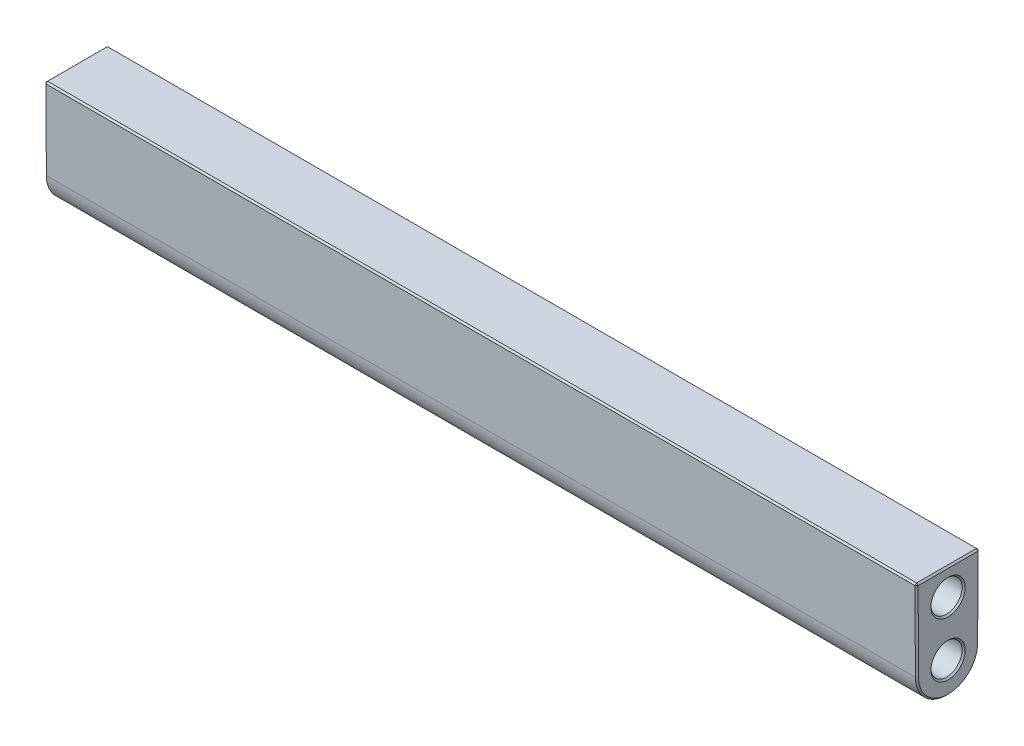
ISO-10303-21;
HEADER;
FILE_DESCRIPTION(('STEP AP214'),'2;1');
FILE_NAME('part.step','',(''),(''),'','','');
FILE_SCHEMA(('AUTOMOTIVE_DESIGN { 1 0 10303 214 1 1 1 1 }'));
ENDSEC;
DATA;
#1=APPLICATION_CONTEXT('core data for automotive mechanical design processes');
#2=APPLICATION_PROTOCOL_DEFINITION('international standard','automotive_design',2000,#1);
#3=PRODUCT_CONTEXT('',#1,'mechanical');
#4=PRODUCT('Part','Part','',(#3));
#5=PRODUCT_RELATED_PRODUCT_CATEGORY('part','',(#4));
#6=PRODUCT_DEFINITION_FORMATION('','',#4);
#7=PRODUCT_DEFINITION_CONTEXT('part definition',#1,'design');
#8=PRODUCT_DEFINITION('design','',#6,#7);
#9=PRODUCT_DEFINITION_SHAPE('','',#8);
#10=(LENGTH_UNIT() NAMED_UNIT(*) SI_UNIT(.MILLI.,.METRE.));
#11=(NAMED_UNIT(*) PLANE_ANGLE_UNIT() SI_UNIT($,.RADIAN.));
#12=(NAMED_UNIT(*) SI_UNIT($,.STERADIAN.) SOLID_ANGLE_UNIT());
#13=UNCERTAINTY_MEASURE_WITH_UNIT(LENGTH_MEASURE(1.E-05),#10,'distance_accuracy_value','');
#14=(GEOMETRIC_REPRESENTATION_CONTEXT(3) GLOBAL_UNCERTAINTY_ASSIGNED_CONTEXT((#13)) GLOBAL_UNIT_ASSIGNED_CONTEXT((#10,
#11,#12)) REPRESENTATION_CONTEXT('',''));
#15=CARTESIAN_POINT('',(0.,0.,0.));
#16=DIRECTION('',(0.,0.,1.));
#17=DIRECTION('',(1.,0.,0.));
#18=AXIS2_PLACEMENT_3D('',#15,#16,#17);
#19=CARTESIAN_POINT('',(-140.,0.,0.));
#20=DIRECTION('',(1.,0.,0.));
#21=DIRECTION('',(0.,0.,-1.));
#22=AXIS2_PLACEMENT_3D('',#19,#20,#21);
#23=PLANE('',#22);
#24=CARTESIAN_POINT('',(-140.,0.,0.));
#25=DIRECTION('',(1.,0.,0.));
#26=DIRECTION('',(0.,0.,-1.));
#27=AXIS2_PLACEMENT_3D('',#24,#25,#26);
#28=CIRCLE('',#27,5.50000000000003);
#29=CARTESIAN_POINT('',(-140.,0.,-5.50000000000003));
#30=VERTEX_POINT('',#29);
#31=EDGE_CURVE('E181',#30,#30,#28,.T.);
#32=ORIENTED_EDGE('',*,*,#31,.T.);
#33=EDGE_LOOP('',(#32));
#34=FACE_BOUND('',#33,.T.);
#35=CARTESIAN_POINT('',(-140.,17.5,0.));
#36=DIRECTION('',(1.,0.,0.));
#37=DIRECTION('',(0.,0.,-1.));
#38=AXIS2_PLACEMENT_3D('',#35,#36,#37);
#39=CIRCLE('',#38,5.50000000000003);
#40=CARTESIAN_POINT('',(-140.,17.5,-5.50000000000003));
#41=VERTEX_POINT('',#40);
#42=EDGE_CURVE('E178',#41,#41,#39,.T.);
#43=ORIENTED_EDGE('',*,*,#42,.T.);
#44=EDGE_LOOP('',(#43));
#45=FACE_BOUND('',#44,.T.);
#46=DIRECTION('',(0.,0.999991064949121,0.00422729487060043));
#47=VECTOR('',#46,1.);
#48=CARTESIAN_POINT('',(-140.,-0.0401593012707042,9.49991511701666));
#49=LINE('',#48,#47);
#50=CARTESIAN_POINT('',(-140.,-0.0401593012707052,9.49991511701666));
#51=VERTEX_POINT('',#50);
#52=CARTESIAN_POINT('',(-140.,25.5,9.60788186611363));
#53=VERTEX_POINT('',#52);
#54=EDGE_CURVE('E119',#51,#53,#49,.T.);
#55=ORIENTED_EDGE('',*,*,#54,.T.);
#56=DIRECTION('',(0.,0.,-1.));
#57=VECTOR('',#56,1.);
#58=CARTESIAN_POINT('',(-140.,25.5,0.));
#59=LINE('',#58,#57);
#60=CARTESIAN_POINT('',(-140.,25.5,-9.60788186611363));
#61=VERTEX_POINT('',#60);
#62=EDGE_CURVE('E115',#53,#61,#59,.T.);
#63=ORIENTED_EDGE('',*,*,#62,.T.);
#64=DIRECTION('',(0.,-0.999991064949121,0.00422729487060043));
#65=VECTOR('',#64,1.);
#66=CARTESIAN_POINT('',(-140.,-0.0401593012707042,-9.49991511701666));
#67=LINE('',#66,#65);
#68=CARTESIAN_POINT('',(-140.,-0.0401593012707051,-9.49991511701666));
#69=VERTEX_POINT('',#68);
#70=EDGE_CURVE('E110',#61,#69,#67,.T.);
#71=ORIENTED_EDGE('',*,*,#70,.T.);
#72=CARTESIAN_POINT('',(-140.,0.,0.));
#73=DIRECTION('',(1.,0.,0.));
#74=DIRECTION('',(0.,0.,-1.));
#75=AXIS2_PLACEMENT_3D('',#72,#73,#74);
#76=CIRCLE('',#75,9.50000000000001);
#77=EDGE_CURVE('E112',#69,#51,#76,.F.);
#78=ORIENTED_EDGE('',*,*,#77,.T.);
#79=EDGE_LOOP('',(#55,#63,#71,#78));
#80=FACE_BOUND('',#79,.T.);
#81=ADVANCED_FACE('F33',(#34,#45,#80),#23,.F.);
#82=CARTESIAN_POINT('',(140.,0.,0.));
#83=DIRECTION('',(-1.,0.,0.));
#84=DIRECTION('',(0.,0.,1.));
#85=AXIS2_PLACEMENT_3D('',#82,#83,#84);
#86=CYLINDRICAL_SURFACE('',#85,10.);
#87=DIRECTION('',(-1.,0.,0.));
#88=VECTOR('',#87,1.);
#89=CARTESIAN_POINT('',(140.,-0.0422729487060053,9.99991064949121));
#90=LINE('',#89,#88);
#91=CARTESIAN_POINT('',(139.5,-0.0422729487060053,9.99991064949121));
#92=VERTEX_POINT('',#91);
#93=CARTESIAN_POINT('',(-139.5,-0.0422729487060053,9.99991064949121));
#94=VERTEX_POINT('',#93);
#95=EDGE_CURVE('E165',#92,#94,#90,.T.);
#96=ORIENTED_EDGE('',*,*,#95,.T.);
#97=CARTESIAN_POINT('',(-139.5,0.,0.));
#98=DIRECTION('',(1.,0.,0.));
#99=DIRECTION('',(0.,0.,-1.));
#100=AXIS2_PLACEMENT_3D('',#97,#98,#99);
#101=CIRCLE('',#100,10.);
#102=CARTESIAN_POINT('',(-139.5,-0.0422729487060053,-9.99991064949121));
#103=VERTEX_POINT('',#102);
#104=EDGE_CURVE('E11',#94,#103,#101,.T.);
#105=ORIENTED_EDGE('',*,*,#104,.T.);
#106=DIRECTION('',(-1.,0.,0.));
#107=VECTOR('',#106,1.);
#108=CARTESIAN_POINT('',(140.,-0.0422729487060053,-9.99991064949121));
#109=LINE('',#108,#107);
#110=CARTESIAN_POINT('',(139.5,-0.0422729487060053,-9.99991064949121));
#111=VERTEX_POINT('',#110);
#112=EDGE_CURVE('E130',#111,#103,#109,.T.);
#113=ORIENTED_EDGE('',*,*,#112,.F.);
#114=CARTESIAN_POINT('',(139.5,0.,0.));
#115=DIRECTION('',(1.,0.,0.));
#116=DIRECTION('',(0.,0.,-1.));
#117=AXIS2_PLACEMENT_3D('',#114,#115,#116);
#118=CIRCLE('',#117,10.);
#119=EDGE_CURVE('E42',#111,#92,#118,.F.);
#120=ORIENTED_EDGE('',*,*,#119,.T.);
#121=EDGE_LOOP('',(#96,#105,#113,#120));
#122=FACE_BOUND('',#121,.T.);
#123=ADVANCED_FACE('F283',(#122),#86,.T.);
#124=CARTESIAN_POINT('',(140.,26.,-10.11));
#125=DIRECTION('',(0.,0.00422729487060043,0.999991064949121));
#126=DIRECTION('',(0.,-0.999991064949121,0.00422729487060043));
#127=AXIS2_PLACEMENT_3D('',#124,#125,#126);
#128=PLANE('',#127);
#129=ORIENTED_EDGE('',*,*,#112,.T.);
#130=DIRECTION('',(0.,0.999991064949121,-0.00422729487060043));
#131=VECTOR('',#130,1.);
#132=CARTESIAN_POINT('',(-139.5,26.,-10.11));
#133=LINE('',#132,#131);
#134=CARTESIAN_POINT('',(-139.5,25.5000044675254,-10.1078863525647));
#135=VERTEX_POINT('',#134);
#136=EDGE_CURVE('E133',#103,#135,#133,.T.);
#137=ORIENTED_EDGE('',*,*,#136,.T.);
#138=DIRECTION('',(1.,0.,0.));
#139=VECTOR('',#138,1.);
#140=CARTESIAN_POINT('',(140.,25.5000044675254,-10.1078863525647));
#141=LINE('',#140,#139);
#142=CARTESIAN_POINT('',(139.5,25.5000044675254,-10.1078863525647));
#143=VERTEX_POINT('',#142);
#144=EDGE_CURVE('E246',#135,#143,#141,.T.);
#145=ORIENTED_EDGE('',*,*,#144,.T.);
#146=DIRECTION('',(0.,-0.999991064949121,0.00422729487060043));
#147=VECTOR('',#146,1.);
#148=CARTESIAN_POINT('',(139.5,-0.0422729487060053,-9.99991064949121));
#149=LINE('',#148,#147);
#150=EDGE_CURVE('E244',#143,#111,#149,.T.);
#151=ORIENTED_EDGE('',*,*,#150,.T.);
#152=EDGE_LOOP('',(#129,#137,#145,#151));
#153=FACE_BOUND('',#152,.T.);
#154=ADVANCED_FACE('F299',(#153),#128,.F.);
#155=CARTESIAN_POINT('',(140.,26.,10.11));
#156=DIRECTION('',(0.,-1.,0.));
#157=DIRECTION('',(0.,0.,-1.));
#158=AXIS2_PLACEMENT_3D('',#155,#156,#157);
#159=PLANE('',#158);
#160=DIRECTION('',(-1.,0.,0.));
#161=VECTOR('',#160,1.);
#162=CARTESIAN_POINT('',(140.,26.,-9.61210032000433));
#163=LINE('',#162,#161);
#164=CARTESIAN_POINT('',(139.5,26.,-9.61210032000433));
#165=VERTEX_POINT('',#164);
#166=CARTESIAN_POINT('',(-139.5,26.,-9.61210032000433));
#167=VERTEX_POINT('',#166);
#168=EDGE_CURVE('E239',#165,#167,#163,.T.);
#169=ORIENTED_EDGE('',*,*,#168,.T.);
#170=DIRECTION('',(0.,0.,1.));
#171=VECTOR('',#170,1.);
#172=CARTESIAN_POINT('',(-139.5,26.,10.11));
#173=LINE('',#172,#171);
#174=CARTESIAN_POINT('',(-139.5,26.,9.61000000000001));
#175=VERTEX_POINT('',#174);
#176=EDGE_CURVE('E242',#167,#175,#173,.T.);
#177=ORIENTED_EDGE('',*,*,#176,.T.);
#178=DIRECTION('',(1.,0.,0.));
#179=VECTOR('',#178,1.);
#180=CARTESIAN_POINT('',(140.,26.,9.61000000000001));
#181=LINE('',#180,#179);
#182=CARTESIAN_POINT('',(139.5,26.,9.61000000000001));
#183=VERTEX_POINT('',#182);
#184=EDGE_CURVE('E237',#175,#183,#181,.T.);
#185=ORIENTED_EDGE('',*,*,#184,.T.);
#186=DIRECTION('',(0.,0.,-1.));
#187=VECTOR('',#186,1.);
#188=CARTESIAN_POINT('',(139.5,26.,-10.11));
#189=LINE('',#188,#187);
#190=EDGE_CURVE('E235',#183,#165,#189,.T.);
#191=ORIENTED_EDGE('',*,*,#190,.T.);
#192=EDGE_LOOP('',(#169,#177,#185,#191));
#193=FACE_BOUND('',#192,.T.);
#194=ADVANCED_FACE('F311',(#193),#159,.F.);
#195=CARTESIAN_POINT('',(140.,26.,10.11));
#196=DIRECTION('',(0.,0.00422729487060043,-0.999991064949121));
#197=DIRECTION('',(0.,0.999991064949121,0.00422729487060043));
#198=AXIS2_PLACEMENT_3D('',#195,#196,#197);
#199=PLANE('',#198);
#200=DIRECTION('',(-1.,0.,0.));
#201=VECTOR('',#200,1.);
#202=CARTESIAN_POINT('',(140.,25.5021047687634,10.1078952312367));
#203=LINE('',#202,#201);
#204=CARTESIAN_POINT('',(139.5,25.5021047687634,10.1078952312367));
#205=VERTEX_POINT('',#204);
#206=CARTESIAN_POINT('',(-139.5,25.5021047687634,10.1078952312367));
#207=VERTEX_POINT('',#206);
#208=EDGE_CURVE('E50',#205,#207,#203,.T.);
#209=ORIENTED_EDGE('',*,*,#208,.T.);
#210=DIRECTION('',(0.,-0.999991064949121,-0.00422729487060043));
#211=VECTOR('',#210,1.);
#212=CARTESIAN_POINT('',(-139.5,26.,10.11));
#213=LINE('',#212,#211);
#214=EDGE_CURVE('E252',#207,#94,#213,.T.);
#215=ORIENTED_EDGE('',*,*,#214,.T.);
#216=ORIENTED_EDGE('',*,*,#95,.F.);
#217=DIRECTION('',(0.,0.999991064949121,0.00422729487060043));
#218=VECTOR('',#217,1.);
#219=CARTESIAN_POINT('',(139.5,26.,10.11));
#220=LINE('',#219,#218);
#221=EDGE_CURVE('E55',#92,#205,#220,.T.);
#222=ORIENTED_EDGE('',*,*,#221,.T.);
#223=EDGE_LOOP('',(#209,#215,#216,#222));
#224=FACE_BOUND('',#223,.T.);
#225=ADVANCED_FACE('F284',(#224),#199,.F.);
#226=CARTESIAN_POINT('',(140.,0.,0.));
#227=DIRECTION('',(1.,0.,0.));
#228=DIRECTION('',(0.,0.,-1.));
#229=AXIS2_PLACEMENT_3D('',#226,#227,#228);
#230=PLANE('',#229);
#231=CARTESIAN_POINT('',(140.,0.,0.));
#232=DIRECTION('',(1.,0.,0.));
#233=DIRECTION('',(0.,0.,-1.));
#234=AXIS2_PLACEMENT_3D('',#231,#232,#233);
#235=CIRCLE('',#234,5.49999999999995);
#236=CARTESIAN_POINT('',(140.,0.,-5.49999999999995));
#237=VERTEX_POINT('',#236);
#238=EDGE_CURVE('E220',#237,#237,#235,.F.);
#239=ORIENTED_EDGE('',*,*,#238,.T.);
#240=EDGE_LOOP('',(#239));
#241=FACE_BOUND('',#240,.T.);
#242=CARTESIAN_POINT('',(140.,17.5,0.));
#243=DIRECTION('',(1.,0.,0.));
#244=DIRECTION('',(0.,0.,-1.));
#245=AXIS2_PLACEMENT_3D('',#242,#243,#244);
#246=CIRCLE('',#245,5.49999999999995);
#247=CARTESIAN_POINT('',(140.,17.5,-5.49999999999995));
#248=VERTEX_POINT('',#247);
#249=EDGE_CURVE('E217',#248,#248,#246,.F.);
#250=ORIENTED_EDGE('',*,*,#249,.T.);
#251=EDGE_LOOP('',(#250));
#252=FACE_BOUND('',#251,.T.);
#253=CARTESIAN_POINT('',(140.,0.,0.));
#254=DIRECTION('',(1.,0.,0.));
#255=DIRECTION('',(0.,0.,-1.));
#256=AXIS2_PLACEMENT_3D('',#253,#254,#255);
#257=CIRCLE('',#256,9.50000000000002);
#258=CARTESIAN_POINT('',(140.,-0.0401593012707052,9.49991511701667));
#259=VERTEX_POINT('',#258);
#260=CARTESIAN_POINT('',(140.,-0.0401593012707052,-9.49991511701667));
#261=VERTEX_POINT('',#260);
#262=EDGE_CURVE('E212',#259,#261,#257,.T.);
#263=ORIENTED_EDGE('',*,*,#262,.T.);
#264=DIRECTION('',(0.,0.999991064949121,-0.00422729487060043));
#265=VECTOR('',#264,1.);
#266=CARTESIAN_POINT('',(140.,26.0021136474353,-9.61000446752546));
#267=LINE('',#266,#265);
#268=CARTESIAN_POINT('',(140.,25.5,-9.60788186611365));
#269=VERTEX_POINT('',#268);
#270=EDGE_CURVE('E214',#261,#269,#267,.T.);
#271=ORIENTED_EDGE('',*,*,#270,.T.);
#272=DIRECTION('',(0.,0.,1.));
#273=VECTOR('',#272,1.);
#274=CARTESIAN_POINT('',(140.,25.5,10.11));
#275=LINE('',#274,#273);
#276=CARTESIAN_POINT('',(140.,25.5,9.60788186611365));
#277=VERTEX_POINT('',#276);
#278=EDGE_CURVE('E210',#269,#277,#275,.T.);
#279=ORIENTED_EDGE('',*,*,#278,.T.);
#280=DIRECTION('',(0.,-0.999991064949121,-0.00422729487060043));
#281=VECTOR('',#280,1.);
#282=CARTESIAN_POINT('',(140.,-0.0401593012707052,9.49991511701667));
#283=LINE('',#282,#281);
#284=EDGE_CURVE('E208',#277,#259,#283,.T.);
#285=ORIENTED_EDGE('',*,*,#284,.T.);
#286=EDGE_LOOP('',(#263,#271,#279,#285));
#287=FACE_BOUND('',#286,.T.);
#288=ADVANCED_FACE('F279',(#241,#252,#287),#230,.T.);
#289=CARTESIAN_POINT('',(120.,0.,0.));
#290=DIRECTION('',(1.,0.,0.));
#291=DIRECTION('',(0.,0.,-1.));
#292=AXIS2_PLACEMENT_3D('',#289,#290,#291);
#293=CYLINDRICAL_SURFACE('',#292,5.);
#294=CARTESIAN_POINT('',(139.5,0.,0.));
#295=DIRECTION('',(1.,0.,0.));
#296=DIRECTION('',(0.,0.,-1.));
#297=AXIS2_PLACEMENT_3D('',#294,#295,#296);
#298=CIRCLE('',#297,5.);
#299=CARTESIAN_POINT('',(139.5,0.,-5.));
#300=VERTEX_POINT('',#299);
#301=EDGE_CURVE('E205',#300,#300,#298,.T.);
#302=ORIENTED_EDGE('',*,*,#301,.T.);
#303=EDGE_LOOP('',(#302));
#304=FACE_BOUND('',#303,.T.);
#305=CARTESIAN_POINT('',(120.5,0.,0.));
#306=DIRECTION('',(1.,0.,0.));
#307=DIRECTION('',(0.,0.,-1.));
#308=AXIS2_PLACEMENT_3D('',#305,#306,#307);
#309=CIRCLE('',#308,5.);
#310=CARTESIAN_POINT('',(120.5,0.,-5.));
#311=VERTEX_POINT('',#310);
#312=EDGE_CURVE('E202',#311,#311,#309,.F.);
#313=ORIENTED_EDGE('',*,*,#312,.T.);
#314=EDGE_LOOP('',(#313));
#315=FACE_BOUND('',#314,.T.);
#316=ADVANCED_FACE('F331',(#304,#315),#293,.F.);
#317=CARTESIAN_POINT('',(120.,0.,0.));
#318=DIRECTION('',(1.,0.,0.));
#319=DIRECTION('',(0.,0.,-1.));
#320=AXIS2_PLACEMENT_3D('',#317,#318,#319);
#321=PLANE('',#320);
#322=CARTESIAN_POINT('',(120.,0.,0.));
#323=DIRECTION('',(1.,0.,0.));
#324=DIRECTION('',(0.,0.,-1.));
#325=AXIS2_PLACEMENT_3D('',#322,#323,#324);
#326=CIRCLE('',#325,4.50000000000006);
#327=CARTESIAN_POINT('',(120.,0.,-4.50000000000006));
#328=VERTEX_POINT('',#327);
#329=EDGE_CURVE('E223',#328,#328,#326,.T.);
#330=ORIENTED_EDGE('',*,*,#329,.T.);
#331=EDGE_LOOP('',(#330));
#332=FACE_BOUND('',#331,.T.);
#333=ADVANCED_FACE('F335',(#332),#321,.T.);
#334=CARTESIAN_POINT('',(120.,17.5,0.));
#335=DIRECTION('',(1.,0.,0.));
#336=DIRECTION('',(0.,0.,-1.));
#337=AXIS2_PLACEMENT_3D('',#334,#335,#336);
#338=CYLINDRICAL_SURFACE('',#337,5.);
#339=CARTESIAN_POINT('',(139.5,17.5,0.));
#340=DIRECTION('',(1.,0.,0.));
#341=DIRECTION('',(0.,0.,-1.));
#342=AXIS2_PLACEMENT_3D('',#339,#340,#341);
#343=CIRCLE('',#342,5.);
#344=CARTESIAN_POINT('',(139.5,17.5,-5.));
#345=VERTEX_POINT('',#344);
#346=EDGE_CURVE('E229',#345,#345,#343,.T.);
#347=ORIENTED_EDGE('',*,*,#346,.T.);
#348=EDGE_LOOP('',(#347));
#349=FACE_BOUND('',#348,.T.);
#350=CARTESIAN_POINT('',(120.5,17.5,0.));
#351=DIRECTION('',(1.,0.,0.));
#352=DIRECTION('',(0.,0.,-1.));
#353=AXIS2_PLACEMENT_3D('',#350,#351,#352);
#354=CIRCLE('',#353,5.);
#355=CARTESIAN_POINT('',(120.5,17.5,-5.));
#356=VERTEX_POINT('',#355);
#357=EDGE_CURVE('E226',#356,#356,#354,.F.);
#358=ORIENTED_EDGE('',*,*,#357,.T.);
#359=EDGE_LOOP('',(#358));
#360=FACE_BOUND('',#359,.T.);
#361=ADVANCED_FACE('F339',(#349,#360),#338,.F.);
#362=CARTESIAN_POINT('',(120.,17.5,0.));
#363=DIRECTION('',(1.,0.,0.));
#364=DIRECTION('',(0.,0.,-1.));
#365=AXIS2_PLACEMENT_3D('',#362,#363,#364);
#366=PLANE('',#365);
#367=CARTESIAN_POINT('',(120.,17.5,0.));
#368=DIRECTION('',(1.,0.,0.));
#369=DIRECTION('',(0.,0.,-1.));
#370=AXIS2_PLACEMENT_3D('',#367,#368,#369);
#371=CIRCLE('',#370,4.50000000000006);
#372=CARTESIAN_POINT('',(120.,17.5,-4.50000000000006));
#373=VERTEX_POINT('',#372);
#374=EDGE_CURVE('E232',#373,#373,#371,.T.);
#375=ORIENTED_EDGE('',*,*,#374,.T.);
#376=EDGE_LOOP('',(#375));
#377=FACE_BOUND('',#376,.T.);
#378=ADVANCED_FACE('F343',(#377),#366,.T.);
#379=CARTESIAN_POINT('',(-120.,0.,0.));
#380=DIRECTION('',(-1.,0.,0.));
#381=DIRECTION('',(0.,0.,1.));
#382=AXIS2_PLACEMENT_3D('',#379,#380,#381);
#383=CYLINDRICAL_SURFACE('',#382,5.);
#384=CARTESIAN_POINT('',(-139.5,0.,0.));
#385=DIRECTION('',(1.,0.,0.));
#386=DIRECTION('',(0.,0.,-1.));
#387=AXIS2_PLACEMENT_3D('',#384,#385,#386);
#388=CIRCLE('',#387,5.);
#389=CARTESIAN_POINT('',(-139.5,0.,-5.));
#390=VERTEX_POINT('',#389);
#391=EDGE_CURVE('E187',#390,#390,#388,.F.);
#392=ORIENTED_EDGE('',*,*,#391,.T.);
#393=EDGE_LOOP('',(#392));
#394=FACE_BOUND('',#393,.T.);
#395=CARTESIAN_POINT('',(-120.5,0.,0.));
#396=DIRECTION('',(-1.,0.,0.));
#397=DIRECTION('',(0.,0.,1.));
#398=AXIS2_PLACEMENT_3D('',#395,#396,#397);
#399=CIRCLE('',#398,5.);
#400=CARTESIAN_POINT('',(-120.5,0.,5.));
#401=VERTEX_POINT('',#400);
#402=EDGE_CURVE('E184',#401,#401,#399,.F.);
#403=ORIENTED_EDGE('',*,*,#402,.T.);
#404=EDGE_LOOP('',(#403));
#405=FACE_BOUND('',#404,.T.);
#406=ADVANCED_FACE('F347',(#394,#405),#383,.F.);
#407=CARTESIAN_POINT('',(-120.,0.,0.));
#408=DIRECTION('',(-1.,0.,0.));
#409=DIRECTION('',(0.,0.,-1.));
#410=AXIS2_PLACEMENT_3D('',#407,#408,#409);
#411=PLANE('',#410);
#412=CARTESIAN_POINT('',(-120.,0.,0.));
#413=DIRECTION('',(-1.,0.,0.));
#414=DIRECTION('',(0.,0.,1.));
#415=AXIS2_PLACEMENT_3D('',#412,#413,#414);
#416=CIRCLE('',#415,4.49999999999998);
#417=CARTESIAN_POINT('',(-120.,0.,4.49999999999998));
#418=VERTEX_POINT('',#417);
#419=EDGE_CURVE('E190',#418,#418,#416,.T.);
#420=ORIENTED_EDGE('',*,*,#419,.T.);
#421=EDGE_LOOP('',(#420));
#422=FACE_BOUND('',#421,.T.);
#423=ADVANCED_FACE('F351',(#422),#411,.T.);
#424=CARTESIAN_POINT('',(-120.,17.5,0.));
#425=DIRECTION('',(-1.,0.,0.));
#426=DIRECTION('',(0.,0.,1.));
#427=AXIS2_PLACEMENT_3D('',#424,#425,#426);
#428=CYLINDRICAL_SURFACE('',#427,5.);
#429=CARTESIAN_POINT('',(-139.5,17.5,0.));
#430=DIRECTION('',(1.,0.,0.));
#431=DIRECTION('',(0.,0.,-1.));
#432=AXIS2_PLACEMENT_3D('',#429,#430,#431);
#433=CIRCLE('',#432,5.);
#434=CARTESIAN_POINT('',(-139.5,17.5,-5.));
#435=VERTEX_POINT('',#434);
#436=EDGE_CURVE('E196',#435,#435,#433,.F.);
#437=ORIENTED_EDGE('',*,*,#436,.T.);
#438=EDGE_LOOP('',(#437));
#439=FACE_BOUND('',#438,.T.);
#440=CARTESIAN_POINT('',(-120.5,17.5,0.));
#441=DIRECTION('',(-1.,0.,0.));
#442=DIRECTION('',(0.,0.,1.));
#443=AXIS2_PLACEMENT_3D('',#440,#441,#442);
#444=CIRCLE('',#443,5.);
#445=CARTESIAN_POINT('',(-120.5,17.5,5.));
#446=VERTEX_POINT('',#445);
#447=EDGE_CURVE('E193',#446,#446,#444,.F.);
#448=ORIENTED_EDGE('',*,*,#447,.T.);
#449=EDGE_LOOP('',(#448));
#450=FACE_BOUND('',#449,.T.);
#451=ADVANCED_FACE('F355',(#439,#450),#428,.F.);
#452=CARTESIAN_POINT('',(-120.,17.5,0.));
#453=DIRECTION('',(-1.,0.,0.));
#454=DIRECTION('',(0.,0.,-1.));
#455=AXIS2_PLACEMENT_3D('',#452,#453,#454);
#456=PLANE('',#455);
#457=CARTESIAN_POINT('',(-120.,17.5,0.));
#458=DIRECTION('',(-1.,0.,0.));
#459=DIRECTION('',(0.,0.,1.));
#460=AXIS2_PLACEMENT_3D('',#457,#458,#459);
#461=CIRCLE('',#460,4.49999999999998);
#462=CARTESIAN_POINT('',(-120.,17.5,4.49999999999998));
#463=VERTEX_POINT('',#462);
#464=EDGE_CURVE('E199',#463,#463,#461,.T.);
#465=ORIENTED_EDGE('',*,*,#464,.T.);
#466=EDGE_LOOP('',(#465));
#467=FACE_BOUND('',#466,.T.);
#468=ADVANCED_FACE('F359',(#467),#456,.T.);
#469=CARTESIAN_POINT('',(-140.,0.,0.));
#470=DIRECTION('',(-1.,0.,0.));
#471=DIRECTION('',(0.,0.,1.));
#472=AXIS2_PLACEMENT_3D('',#469,#470,#471);
#473=CONICAL_SURFACE('',#472,5.50000000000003,0.785398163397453);
#474=ORIENTED_EDGE('',*,*,#391,.F.);
#475=EDGE_LOOP('',(#474));
#476=FACE_BOUND('',#475,.T.);
#477=ORIENTED_EDGE('',*,*,#31,.F.);
#478=EDGE_LOOP('',(#477));
#479=FACE_BOUND('',#478,.T.);
#480=ADVANCED_FACE('F362',(#476,#479),#473,.F.);
#481=CARTESIAN_POINT('',(-120.5,0.,0.));
#482=DIRECTION('',(-1.,0.,0.));
#483=DIRECTION('',(0.,0.,1.));
#484=AXIS2_PLACEMENT_3D('',#481,#482,#483);
#485=CONICAL_SURFACE('',#484,5.,0.785398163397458);
#486=ORIENTED_EDGE('',*,*,#419,.F.);
#487=EDGE_LOOP('',(#486));
#488=FACE_BOUND('',#487,.T.);
#489=ORIENTED_EDGE('',*,*,#402,.F.);
#490=EDGE_LOOP('',(#489));
#491=FACE_BOUND('',#490,.T.);
#492=ADVANCED_FACE('F367',(#488,#491),#485,.F.);
#493=CARTESIAN_POINT('',(-140.,17.5,0.));
#494=DIRECTION('',(-1.,0.,0.));
#495=DIRECTION('',(0.,0.,1.));
#496=AXIS2_PLACEMENT_3D('',#493,#494,#495);
#497=CONICAL_SURFACE('',#496,5.50000000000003,0.785398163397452);
#498=ORIENTED_EDGE('',*,*,#436,.F.);
#499=EDGE_LOOP('',(#498));
#500=FACE_BOUND('',#499,.T.);
#501=ORIENTED_EDGE('',*,*,#42,.F.);
#502=EDGE_LOOP('',(#501));
#503=FACE_BOUND('',#502,.T.);
#504=ADVANCED_FACE('F376',(#500,#503),#497,.F.);
#505=CARTESIAN_POINT('',(-120.5,17.5,0.));
#506=DIRECTION('',(-1.,0.,0.));
#507=DIRECTION('',(0.,0.,1.));
#508=AXIS2_PLACEMENT_3D('',#505,#506,#507);
#509=CONICAL_SURFACE('',#508,5.,0.785398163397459);
#510=ORIENTED_EDGE('',*,*,#464,.F.);
#511=EDGE_LOOP('',(#510));
#512=FACE_BOUND('',#511,.T.);
#513=ORIENTED_EDGE('',*,*,#447,.F.);
#514=EDGE_LOOP('',(#513));
#515=FACE_BOUND('',#514,.T.);
#516=ADVANCED_FACE('F372',(#512,#515),#509,.F.);
#517=CARTESIAN_POINT('',(139.5,0.,0.));
#518=DIRECTION('',(1.,0.,0.));
#519=DIRECTION('',(0.,0.,-1.));
#520=AXIS2_PLACEMENT_3D('',#517,#518,#519);
#521=CONICAL_SURFACE('',#520,5.,0.785398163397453);
#522=ORIENTED_EDGE('',*,*,#238,.F.);
#523=EDGE_LOOP('',(#522));
#524=FACE_BOUND('',#523,.T.);
#525=ORIENTED_EDGE('',*,*,#301,.F.);
#526=EDGE_LOOP('',(#525));
#527=FACE_BOUND('',#526,.T.);
#528=ADVANCED_FACE('F375',(#524,#527),#521,.F.);
#529=CARTESIAN_POINT('',(120.,0.,0.));
#530=DIRECTION('',(1.,0.,0.));
#531=DIRECTION('',(0.,0.,-1.));
#532=AXIS2_PLACEMENT_3D('',#529,#530,#531);
#533=CONICAL_SURFACE('',#532,4.50000000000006,0.785398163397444);
#534=ORIENTED_EDGE('',*,*,#312,.F.);
#535=EDGE_LOOP('',(#534));
#536=FACE_BOUND('',#535,.T.);
#537=ORIENTED_EDGE('',*,*,#329,.F.);
#538=EDGE_LOOP('',(#537));
#539=FACE_BOUND('',#538,.T.);
#540=ADVANCED_FACE('F384',(#536,#539),#533,.F.);
#541=CARTESIAN_POINT('',(139.5,17.5,0.));
#542=DIRECTION('',(1.,0.,0.));
#543=DIRECTION('',(0.,0.,-1.));
#544=AXIS2_PLACEMENT_3D('',#541,#542,#543);
#545=CONICAL_SURFACE('',#544,5.,0.785398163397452);
#546=ORIENTED_EDGE('',*,*,#249,.F.);
#547=EDGE_LOOP('',(#546));
#548=FACE_BOUND('',#547,.T.);
#549=ORIENTED_EDGE('',*,*,#346,.F.);
#550=EDGE_LOOP('',(#549));
#551=FACE_BOUND('',#550,.T.);
#552=ADVANCED_FACE('F393',(#548,#551),#545,.F.);
#553=CARTESIAN_POINT('',(120.,17.5,0.));
#554=DIRECTION('',(1.,0.,0.));
#555=DIRECTION('',(0.,0.,-1.));
#556=AXIS2_PLACEMENT_3D('',#553,#554,#555);
#557=CONICAL_SURFACE('',#556,4.50000000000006,0.785398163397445);
#558=ORIENTED_EDGE('',*,*,#357,.F.);
#559=EDGE_LOOP('',(#558));
#560=FACE_BOUND('',#559,.T.);
#561=ORIENTED_EDGE('',*,*,#374,.F.);
#562=EDGE_LOOP('',(#561));
#563=FACE_BOUND('',#562,.T.);
#564=ADVANCED_FACE('F397',(#560,#563),#557,.F.);
#565=CARTESIAN_POINT('',(140.,-0.0401593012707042,9.49991511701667));
#566=DIRECTION('',(0.707106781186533,-0.00298914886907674,0.707100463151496));
#567=DIRECTION('',(0.707103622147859,0.,-0.707109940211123));
#568=AXIS2_PLACEMENT_3D('',#565,#566,#567);
#569=PLANE('',#568);
#570=DIRECTION('',(0.707094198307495,-0.00297653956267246,-0.707113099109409));
#571=VECTOR('',#570,1.);
#572=CARTESIAN_POINT('',(139.747897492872,25.5010612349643,9.85999111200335));
#573=LINE('',#572,#571);
#574=EDGE_CURVE('E159',#205,#277,#573,.T.);
#575=ORIENTED_EDGE('',*,*,#574,.F.);
#576=ORIENTED_EDGE('',*,*,#221,.F.);
#577=DIRECTION('',(-0.707106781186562,-0.00298914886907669,0.707100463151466));
#578=VECTOR('',#577,1.);
#579=CARTESIAN_POINT('',(140.,-0.0401593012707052,9.49991511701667));
#580=LINE('',#579,#578);
#581=EDGE_CURVE('E37',#259,#92,#580,.T.);
#582=ORIENTED_EDGE('',*,*,#581,.F.);
#583=ORIENTED_EDGE('',*,*,#284,.F.);
#584=EDGE_LOOP('',(#575,#576,#582,#583));
#585=FACE_BOUND('',#584,.T.);
#586=ADVANCED_FACE('F35',(#585),#569,.T.);
#587=CARTESIAN_POINT('',(140.,25.5021047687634,10.1078952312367));
#588=DIRECTION('',(0.,-0.707106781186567,-0.707106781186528));
#589=DIRECTION('',(0.,0.707106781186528,-0.707106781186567));
#590=AXIS2_PLACEMENT_3D('',#587,#588,#589);
#591=PLANE('',#590);
#592=DIRECTION('',(0.,-0.707106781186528,0.707106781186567));
#593=VECTOR('',#592,1.);
#594=CARTESIAN_POINT('',(-139.5,25.5021047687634,10.1078952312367));
#595=LINE('',#594,#593);
#596=EDGE_CURVE('E154',#207,#175,#595,.F.);
#597=ORIENTED_EDGE('',*,*,#596,.F.);
#598=ORIENTED_EDGE('',*,*,#208,.F.);
#599=DIRECTION('',(0.,0.707106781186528,-0.707106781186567));
#600=VECTOR('',#599,1.);
#601=CARTESIAN_POINT('',(139.5,26.,9.61000000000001));
#602=LINE('',#601,#600);
#603=EDGE_CURVE('E157',#183,#205,#602,.F.);
#604=ORIENTED_EDGE('',*,*,#603,.F.);
#605=ORIENTED_EDGE('',*,*,#184,.F.);
#606=EDGE_LOOP('',(#597,#598,#604,#605));
#607=FACE_BOUND('',#606,.T.);
#608=ADVANCED_FACE('F291',(#607),#591,.F.);
#609=CARTESIAN_POINT('',(-139.5,26.,10.11));
#610=DIRECTION('',(0.707106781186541,0.0029891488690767,-0.707100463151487));
#611=DIRECTION('',(-0.707103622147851,0.,-0.707109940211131));
#612=AXIS2_PLACEMENT_3D('',#609,#610,#611);
#613=PLANE('',#612);
#614=DIRECTION('',(-0.707106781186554,0.00298914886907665,-0.707100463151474));
#615=VECTOR('',#614,1.);
#616=CARTESIAN_POINT('',(-139.5,-0.0422729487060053,9.99991064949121));
#617=LINE('',#616,#615);
#618=EDGE_CURVE('E129',#94,#51,#617,.T.);
#619=ORIENTED_EDGE('',*,*,#618,.F.);
#620=ORIENTED_EDGE('',*,*,#214,.F.);
#621=DIRECTION('',(-0.707094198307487,-0.00297653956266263,-0.707113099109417));
#622=VECTOR('',#621,1.);
#623=CARTESIAN_POINT('',(-139.5,25.5021047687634,10.1078952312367));
#624=LINE('',#623,#622);
#625=EDGE_CURVE('E151',#53,#207,#624,.F.);
#626=ORIENTED_EDGE('',*,*,#625,.F.);
#627=ORIENTED_EDGE('',*,*,#54,.F.);
#628=EDGE_LOOP('',(#619,#620,#626,#627));
#629=FACE_BOUND('',#628,.T.);
#630=ADVANCED_FACE('F297',(#629),#613,.F.);
#631=CARTESIAN_POINT('',(140.,0.,0.));
#632=DIRECTION('',(-1.,0.,0.));
#633=DIRECTION('',(0.,0.,1.));
#634=AXIS2_PLACEMENT_3D('',#631,#632,#633);
#635=CONICAL_SURFACE('',#634,9.50000000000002,0.785398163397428);
#636=ORIENTED_EDGE('',*,*,#581,.T.);
#637=ORIENTED_EDGE('',*,*,#119,.F.);
#638=DIRECTION('',(-0.707106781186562,-0.00298914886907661,-0.707100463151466));
#639=VECTOR('',#638,1.);
#640=CARTESIAN_POINT('',(140.,-0.0401593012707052,-9.49991511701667));
#641=LINE('',#640,#639);
#642=EDGE_CURVE('E147',#261,#111,#641,.T.);
#643=ORIENTED_EDGE('',*,*,#642,.F.);
#644=ORIENTED_EDGE('',*,*,#262,.F.);
#645=EDGE_LOOP('',(#636,#637,#643,#644));
#646=FACE_BOUND('',#645,.T.);
#647=ADVANCED_FACE('F281',(#646),#635,.T.);
#648=CARTESIAN_POINT('',(139.5,26.,9.61000000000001));
#649=DIRECTION('',(0.578977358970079,0.576535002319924,0.576535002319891));
#650=DIRECTION('',(-0.705610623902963,0.708599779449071,0.));
#651=AXIS2_PLACEMENT_3D('',#648,#649,#650);
#652=PLANE('',#651);
#653=ORIENTED_EDGE('',*,*,#603,.T.);
#654=ORIENTED_EDGE('',*,*,#574,.T.);
#655=DIRECTION('',(-0.707103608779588,0.707103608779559,0.00299548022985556));
#656=VECTOR('',#655,1.);
#657=CARTESIAN_POINT('',(139.5,26.,9.61000000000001));
#658=LINE('',#657,#656);
#659=EDGE_CURVE('E138',#183,#277,#658,.F.);
#660=ORIENTED_EDGE('',*,*,#659,.F.);
#661=EDGE_LOOP('',(#653,#654,#660));
#662=FACE_BOUND('',#661,.T.);
#663=ADVANCED_FACE('F287',(#662),#652,.T.);
#664=CARTESIAN_POINT('',(-139.5,25.5021047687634,10.1078952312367));
#665=DIRECTION('',(-0.578977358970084,0.576535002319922,0.57653500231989));
#666=DIRECTION('',(-0.705610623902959,-0.708599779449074,0.));
#667=AXIS2_PLACEMENT_3D('',#664,#665,#666);
#668=PLANE('',#667);
#669=ORIENTED_EDGE('',*,*,#625,.T.);
#670=ORIENTED_EDGE('',*,*,#596,.T.);
#671=DIRECTION('',(0.707103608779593,0.707103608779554,0.00299548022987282));
#672=VECTOR('',#671,1.);
#673=CARTESIAN_POINT('',(-139.747890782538,25.7521092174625,9.60894986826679));
#674=LINE('',#673,#672);
#675=EDGE_CURVE('E134',#53,#175,#674,.T.);
#676=ORIENTED_EDGE('',*,*,#675,.F.);
#677=EDGE_LOOP('',(#669,#670,#676));
#678=FACE_BOUND('',#677,.T.);
#679=ADVANCED_FACE('F295',(#678),#668,.T.);
#680=CARTESIAN_POINT('',(-139.5,0.,0.));
#681=DIRECTION('',(1.,0.,0.));
#682=DIRECTION('',(0.,0.,-1.));
#683=AXIS2_PLACEMENT_3D('',#680,#681,#682);
#684=CONICAL_SURFACE('',#683,10.,0.78539816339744);
#685=ORIENTED_EDGE('',*,*,#618,.T.);
#686=ORIENTED_EDGE('',*,*,#77,.F.);
#687=DIRECTION('',(-0.707106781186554,0.00298914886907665,0.707100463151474));
#688=VECTOR('',#687,1.);
#689=CARTESIAN_POINT('',(-139.5,-0.0422729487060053,-9.99991064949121));
#690=LINE('',#689,#688);
#691=EDGE_CURVE('E126',#103,#69,#690,.T.);
#692=ORIENTED_EDGE('',*,*,#691,.F.);
#693=ORIENTED_EDGE('',*,*,#104,.F.);
#694=EDGE_LOOP('',(#685,#686,#692,#693));
#695=FACE_BOUND('',#694,.T.);
#696=ADVANCED_FACE('F124',(#695),#684,.T.);
#697=CARTESIAN_POINT('',(140.,-0.0401593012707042,-9.49991511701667));
#698=DIRECTION('',(0.707106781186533,-0.00298914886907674,-0.707100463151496));
#699=DIRECTION('',(-0.707103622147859,0.,-0.707109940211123));
#700=AXIS2_PLACEMENT_3D('',#697,#698,#699);
#701=PLANE('',#700);
#702=ORIENTED_EDGE('',*,*,#642,.T.);
#703=ORIENTED_EDGE('',*,*,#150,.F.);
#704=DIRECTION('',(-0.707103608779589,6.31800668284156E-06,-0.707109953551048));
#705=VECTOR('',#704,1.);
#706=CARTESIAN_POINT('',(139.5,25.5000044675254,-10.1078863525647));
#707=LINE('',#706,#705);
#708=EDGE_CURVE('E135',#269,#143,#707,.T.);
#709=ORIENTED_EDGE('',*,*,#708,.F.);
#710=ORIENTED_EDGE('',*,*,#270,.F.);
#711=EDGE_LOOP('',(#702,#703,#709,#710));
#712=FACE_BOUND('',#711,.T.);
#713=ADVANCED_FACE('F275',(#712),#701,.T.);
#714=CARTESIAN_POINT('',(140.,25.5,0.));
#715=DIRECTION('',(0.707106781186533,0.707106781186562,0.));
#716=DIRECTION('',(-0.707106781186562,0.707106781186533,0.));
#717=AXIS2_PLACEMENT_3D('',#714,#715,#716);
#718=PLANE('',#717);
#719=ORIENTED_EDGE('',*,*,#659,.T.);
#720=ORIENTED_EDGE('',*,*,#278,.F.);
#721=DIRECTION('',(0.707094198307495,-0.707094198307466,0.00596568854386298));
#722=VECTOR('',#721,1.);
#723=CARTESIAN_POINT('',(139.747897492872,25.7521025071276,-9.61000883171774));
#724=LINE('',#723,#722);
#725=EDGE_CURVE('E141',#165,#269,#724,.T.);
#726=ORIENTED_EDGE('',*,*,#725,.F.);
#727=ORIENTED_EDGE('',*,*,#190,.F.);
#728=EDGE_LOOP('',(#719,#720,#726,#727));
#729=FACE_BOUND('',#728,.T.);
#730=ADVANCED_FACE('F276',(#729),#718,.T.);
#731=CARTESIAN_POINT('',(-139.5,26.,10.11));
#732=DIRECTION('',(0.707106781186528,-0.707106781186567,0.));
#733=DIRECTION('',(0.707106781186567,0.707106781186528,0.));
#734=AXIS2_PLACEMENT_3D('',#731,#732,#733);
#735=PLANE('',#734);
#736=ORIENTED_EDGE('',*,*,#675,.T.);
#737=ORIENTED_EDGE('',*,*,#176,.F.);
#738=DIRECTION('',(-0.7070941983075,-0.707094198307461,0.00596568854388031));
#739=VECTOR('',#738,1.);
#740=CARTESIAN_POINT('',(-139.5,26.,-9.61210032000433));
#741=LINE('',#740,#739);
#742=EDGE_CURVE('E261',#61,#167,#741,.F.);
#743=ORIENTED_EDGE('',*,*,#742,.F.);
#744=ORIENTED_EDGE('',*,*,#62,.F.);
#745=EDGE_LOOP('',(#736,#737,#743,#744));
#746=FACE_BOUND('',#745,.T.);
#747=ADVANCED_FACE('F309',(#746),#735,.F.);
#748=CARTESIAN_POINT('',(-139.5,26.,-10.11));
#749=DIRECTION('',(0.707106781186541,0.0029891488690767,0.707100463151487));
#750=DIRECTION('',(0.707103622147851,0.,-0.707109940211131));
#751=AXIS2_PLACEMENT_3D('',#748,#749,#750);
#752=PLANE('',#751);
#753=ORIENTED_EDGE('',*,*,#691,.T.);
#754=ORIENTED_EDGE('',*,*,#70,.F.);
#755=DIRECTION('',(0.70710360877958,6.31800667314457E-06,-0.707109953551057));
#756=VECTOR('',#755,1.);
#757=CARTESIAN_POINT('',(-139.747890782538,25.5000022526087,-9.85999334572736));
#758=LINE('',#757,#756);
#759=EDGE_CURVE('E259',#135,#61,#758,.F.);
#760=ORIENTED_EDGE('',*,*,#759,.F.);
#761=ORIENTED_EDGE('',*,*,#136,.F.);
#762=EDGE_LOOP('',(#753,#754,#760,#761));
#763=FACE_BOUND('',#762,.T.);
#764=ADVANCED_FACE('F132',(#763),#752,.F.);
#765=CARTESIAN_POINT('',(139.5,25.5000044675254,-10.1078863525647));
#766=DIRECTION('',(0.578977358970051,0.574092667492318,-0.578967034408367));
#767=DIRECTION('',(-0.707100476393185,0.,-0.707113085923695));
#768=AXIS2_PLACEMENT_3D('',#765,#766,#767);
#769=PLANE('',#768);
#770=ORIENTED_EDGE('',*,*,#725,.T.);
#771=ORIENTED_EDGE('',*,*,#708,.T.);
#772=DIRECTION('',(0.,-0.710089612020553,-0.704111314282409));
#773=VECTOR('',#772,1.);
#774=CARTESIAN_POINT('',(139.5,25.5000044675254,-10.1078863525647));
#775=LINE('',#774,#773);
#776=EDGE_CURVE('E257',#165,#143,#775,.T.);
#777=ORIENTED_EDGE('',*,*,#776,.F.);
#778=EDGE_LOOP('',(#770,#771,#777));
#779=FACE_BOUND('',#778,.T.);
#780=ADVANCED_FACE('F267',(#779),#769,.T.);
#781=CARTESIAN_POINT('',(-139.5,26.,-9.61210032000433));
#782=DIRECTION('',(-0.578977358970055,0.574092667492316,-0.578967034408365));
#783=DIRECTION('',(-0.707100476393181,0.,0.707113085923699));
#784=AXIS2_PLACEMENT_3D('',#781,#782,#783);
#785=PLANE('',#784);
#786=ORIENTED_EDGE('',*,*,#759,.T.);
#787=ORIENTED_EDGE('',*,*,#742,.T.);
#788=DIRECTION('',(0.,0.710089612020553,0.704111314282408));
#789=VECTOR('',#788,1.);
#790=CARTESIAN_POINT('',(-139.5,26.,-9.61210032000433));
#791=LINE('',#790,#789);
#792=EDGE_CURVE('E255',#135,#167,#791,.T.);
#793=ORIENTED_EDGE('',*,*,#792,.F.);
#794=EDGE_LOOP('',(#786,#787,#793));
#795=FACE_BOUND('',#794,.T.);
#796=ADVANCED_FACE('F305',(#795),#785,.T.);
#797=CARTESIAN_POINT('',(140.,26.,-9.61210032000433));
#798=DIRECTION('',(0.,-0.704111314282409,0.710089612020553));
#799=DIRECTION('',(0.,-0.710089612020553,-0.704111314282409));
#800=AXIS2_PLACEMENT_3D('',#797,#798,#799);
#801=PLANE('',#800);
#802=ORIENTED_EDGE('',*,*,#776,.T.);
#803=ORIENTED_EDGE('',*,*,#144,.F.);
#804=ORIENTED_EDGE('',*,*,#792,.T.);
#805=ORIENTED_EDGE('',*,*,#168,.F.);
#806=EDGE_LOOP('',(#802,#803,#804,#805));
#807=FACE_BOUND('',#806,.T.);
#808=ADVANCED_FACE('F303',(#807),#801,.F.);
#809=CLOSED_SHELL('',(#81,#123,#154,#194,#225,#288,#316,#333,#361,#378,#406,#423,#451,#468,#480,
#492,#504,#516,#528,#540,#552,#564,#586,#608,#630,#647,#663,#679,#696,#713,#730,#747,#764,#780,
#796,#808));
#810=MANIFOLD_SOLID_BREP('B2',#809);
#811=ADVANCED_BREP_SHAPE_REPRESENTATION('',(#18,#810),#14);
#812=SHAPE_DEFINITION_REPRESENTATION(#9,#811);
ENDSEC;
END-ISO-10303-21;
